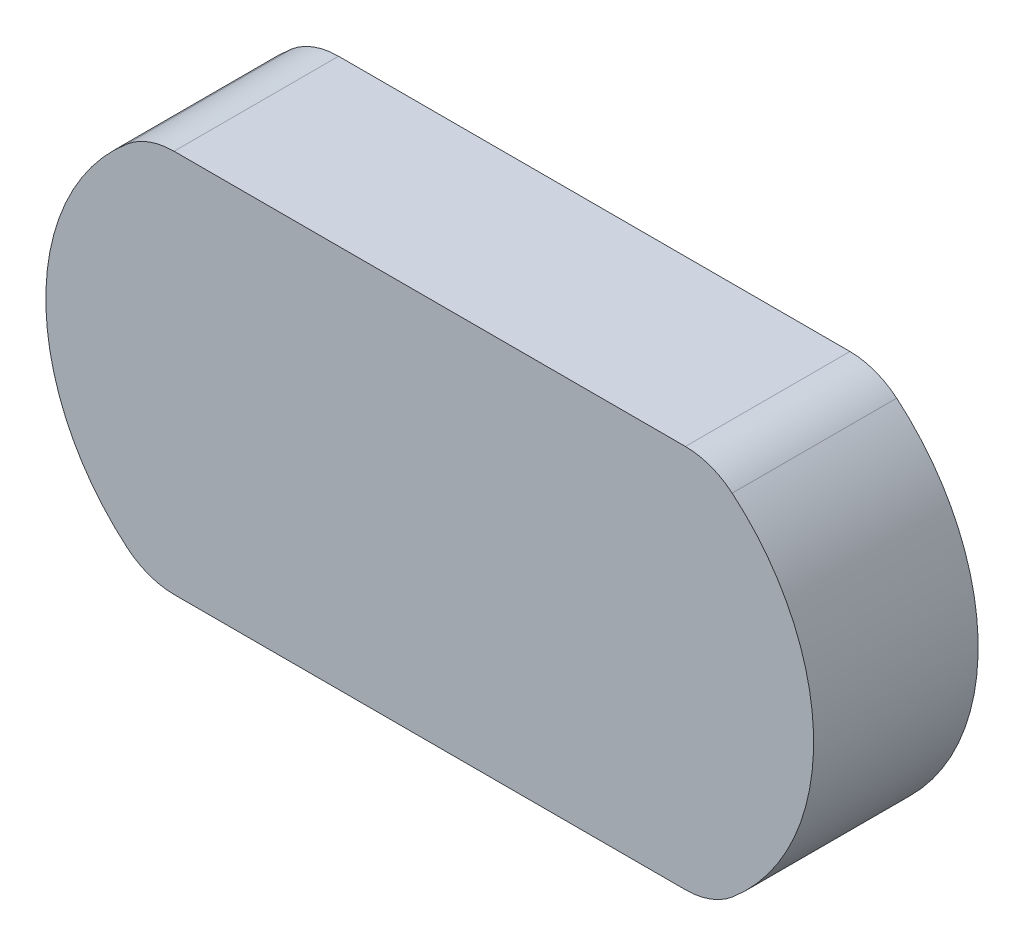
ISO-10303-21;
HEADER;
FILE_DESCRIPTION(('STEP AP214'),'2;1');
FILE_NAME('part.step','',(''),(''),'','','');
FILE_SCHEMA(('AUTOMOTIVE_DESIGN { 1 0 10303 214 1 1 1 1 }'));
ENDSEC;
DATA;
#1=APPLICATION_CONTEXT('core data for automotive mechanical design processes');
#2=APPLICATION_PROTOCOL_DEFINITION('international standard','automotive_design',2000,#1);
#3=PRODUCT_CONTEXT('',#1,'mechanical');
#4=PRODUCT('Part','Part','',(#3));
#5=PRODUCT_RELATED_PRODUCT_CATEGORY('part','',(#4));
#6=PRODUCT_DEFINITION_FORMATION('','',#4);
#7=PRODUCT_DEFINITION_CONTEXT('part definition',#1,'design');
#8=PRODUCT_DEFINITION('design','',#6,#7);
#9=PRODUCT_DEFINITION_SHAPE('','',#8);
#10=(LENGTH_UNIT() NAMED_UNIT(*) SI_UNIT(.MILLI.,.METRE.));
#11=(NAMED_UNIT(*) PLANE_ANGLE_UNIT() SI_UNIT($,.RADIAN.));
#12=(NAMED_UNIT(*) SI_UNIT($,.STERADIAN.) SOLID_ANGLE_UNIT());
#13=UNCERTAINTY_MEASURE_WITH_UNIT(LENGTH_MEASURE(1.E-05),#10,'distance_accuracy_value','');
#14=(GEOMETRIC_REPRESENTATION_CONTEXT(3) GLOBAL_UNCERTAINTY_ASSIGNED_CONTEXT((#13)) GLOBAL_UNIT_ASSIGNED_CONTEXT((#10,
#11,#12)) REPRESENTATION_CONTEXT('',''));
#15=CARTESIAN_POINT('',(0.,0.,0.));
#16=DIRECTION('',(0.,0.,1.));
#17=DIRECTION('',(1.,0.,0.));
#18=AXIS2_PLACEMENT_3D('',#15,#16,#17);
#19=CARTESIAN_POINT('',(-17.,0.,0.));
#20=DIRECTION('',(0.,0.,1.));
#21=DIRECTION('',(1.,0.,0.));
#22=AXIS2_PLACEMENT_3D('',#19,#20,#21);
#23=PLANE('',#22);
#24=CARTESIAN_POINT('',(-27.9726204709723,-13.0498,0.));
#25=DIRECTION('',(0.,0.,-1.));
#26=DIRECTION('',(-1.,0.,0.));
#27=AXIS2_PLACEMENT_3D('',#24,#25,#26);
#28=CIRCLE('',#27,7.9502);
#29=CARTESIAN_POINT('',(-33.0890750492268,-19.1348285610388,0.));
#30=VERTEX_POINT('',#29);
#31=CARTESIAN_POINT('',(-27.9726204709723,-21.,0.));
#32=VERTEX_POINT('',#31);
#33=EDGE_CURVE('E91',#30,#32,#28,.F.);
#34=ORIENTED_EDGE('',*,*,#33,.F.);
#35=CARTESIAN_POINT('',(-17.,0.,0.));
#36=DIRECTION('',(0.,0.,-1.));
#37=DIRECTION('',(-1.,0.,0.));
#38=AXIS2_PLACEMENT_3D('',#35,#36,#37);
#39=CIRCLE('',#38,25.);
#40=CARTESIAN_POINT('',(-33.0890750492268,19.1348285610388,0.));
#41=VERTEX_POINT('',#40);
#42=EDGE_CURVE('E20',#41,#30,#39,.F.);
#43=ORIENTED_EDGE('',*,*,#42,.F.);
#44=CARTESIAN_POINT('',(-27.9726204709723,13.0498,0.));
#45=DIRECTION('',(0.,0.,-1.));
#46=DIRECTION('',(-1.,0.,0.));
#47=AXIS2_PLACEMENT_3D('',#44,#45,#46);
#48=CIRCLE('',#47,7.9502);
#49=CARTESIAN_POINT('',(-27.9726204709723,21.,0.));
#50=VERTEX_POINT('',#49);
#51=EDGE_CURVE('E122',#50,#41,#48,.F.);
#52=ORIENTED_EDGE('',*,*,#51,.F.);
#53=DIRECTION('',(1.,0.,0.));
#54=VECTOR('',#53,1.);
#55=CARTESIAN_POINT('',(-30.5646599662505,21.,0.));
#56=LINE('',#55,#54);
#57=CARTESIAN_POINT('',(27.9726204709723,21.,0.));
#58=VERTEX_POINT('',#57);
#59=EDGE_CURVE('E104',#50,#58,#56,.T.);
#60=ORIENTED_EDGE('',*,*,#59,.T.);
#61=CARTESIAN_POINT('',(27.9726204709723,13.0498,0.));
#62=DIRECTION('',(0.,0.,-1.));
#63=DIRECTION('',(-1.,0.,0.));
#64=AXIS2_PLACEMENT_3D('',#61,#62,#63);
#65=CIRCLE('',#64,7.9502);
#66=CARTESIAN_POINT('',(33.0890750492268,19.1348285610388,0.));
#67=VERTEX_POINT('',#66);
#68=EDGE_CURVE('E107',#67,#58,#65,.F.);
#69=ORIENTED_EDGE('',*,*,#68,.F.);
#70=CARTESIAN_POINT('',(17.,0.,0.));
#71=DIRECTION('',(0.,0.,-1.));
#72=DIRECTION('',(-1.,0.,0.));
#73=AXIS2_PLACEMENT_3D('',#70,#71,#72);
#74=CIRCLE('',#73,25.);
#75=CARTESIAN_POINT('',(33.0890750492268,-19.1348285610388,0.));
#76=VERTEX_POINT('',#75);
#77=EDGE_CURVE('E127',#76,#67,#74,.F.);
#78=ORIENTED_EDGE('',*,*,#77,.F.);
#79=CARTESIAN_POINT('',(27.9726204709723,-13.0498,0.));
#80=DIRECTION('',(0.,0.,-1.));
#81=DIRECTION('',(-1.,0.,0.));
#82=AXIS2_PLACEMENT_3D('',#79,#80,#81);
#83=CIRCLE('',#82,7.9502);
#84=CARTESIAN_POINT('',(27.9726204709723,-21.,0.));
#85=VERTEX_POINT('',#84);
#86=EDGE_CURVE('E130',#85,#76,#83,.F.);
#87=ORIENTED_EDGE('',*,*,#86,.F.);
#88=DIRECTION('',(1.,0.,0.));
#89=VECTOR('',#88,1.);
#90=CARTESIAN_POINT('',(-30.5646599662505,-21.,0.));
#91=LINE('',#90,#89);
#92=EDGE_CURVE('E93',#85,#32,#91,.F.);
#93=ORIENTED_EDGE('',*,*,#92,.T.);
#94=EDGE_LOOP('',(#34,#43,#52,#60,#69,#78,#87,#93));
#95=FACE_BOUND('',#94,.T.);
#96=ADVANCED_FACE('F17',(#95),#23,.F.);
#97=CARTESIAN_POINT('',(-17.,0.,18.));
#98=DIRECTION('',(0.,0.,-1.));
#99=DIRECTION('',(-1.,0.,0.));
#100=AXIS2_PLACEMENT_3D('',#97,#98,#99);
#101=CYLINDRICAL_SURFACE('',#100,25.);
#102=ORIENTED_EDGE('',*,*,#42,.T.);
#103=DIRECTION('',(0.,0.,-1.));
#104=VECTOR('',#103,1.);
#105=CARTESIAN_POINT('',(-33.0890750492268,-19.1348285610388,18.));
#106=LINE('',#105,#104);
#107=CARTESIAN_POINT('',(-33.0890750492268,-19.1348285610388,18.));
#108=VERTEX_POINT('',#107);
#109=EDGE_CURVE('E83',#108,#30,#106,.T.);
#110=ORIENTED_EDGE('',*,*,#109,.F.);
#111=CARTESIAN_POINT('',(-17.,0.,18.));
#112=DIRECTION('',(0.,0.,-1.));
#113=DIRECTION('',(-1.,0.,0.));
#114=AXIS2_PLACEMENT_3D('',#111,#112,#113);
#115=CIRCLE('',#114,25.);
#116=CARTESIAN_POINT('',(-33.0890750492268,19.1348285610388,18.));
#117=VERTEX_POINT('',#116);
#118=EDGE_CURVE('E120',#117,#108,#115,.F.);
#119=ORIENTED_EDGE('',*,*,#118,.F.);
#120=DIRECTION('',(0.,0.,-1.));
#121=VECTOR('',#120,1.);
#122=CARTESIAN_POINT('',(-33.0890750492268,19.1348285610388,18.));
#123=LINE('',#122,#121);
#124=EDGE_CURVE('E86',#41,#117,#123,.F.);
#125=ORIENTED_EDGE('',*,*,#124,.F.);
#126=EDGE_LOOP('',(#102,#110,#119,#125));
#127=FACE_BOUND('',#126,.T.);
#128=ADVANCED_FACE('F81',(#127),#101,.T.);
#129=CARTESIAN_POINT('',(-27.9726204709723,-13.0498,18.));
#130=DIRECTION('',(0.,0.,-1.));
#131=DIRECTION('',(-1.,0.,0.));
#132=AXIS2_PLACEMENT_3D('',#129,#130,#131);
#133=CYLINDRICAL_SURFACE('',#132,7.9502);
#134=ORIENTED_EDGE('',*,*,#33,.T.);
#135=DIRECTION('',(0.,0.,1.));
#136=VECTOR('',#135,1.);
#137=CARTESIAN_POINT('',(-27.9726204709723,-21.,18.));
#138=LINE('',#137,#136);
#139=CARTESIAN_POINT('',(-27.9726204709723,-21.,18.));
#140=VERTEX_POINT('',#139);
#141=EDGE_CURVE('E102',#32,#140,#138,.T.);
#142=ORIENTED_EDGE('',*,*,#141,.T.);
#143=CARTESIAN_POINT('',(-27.9726204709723,-13.0498,18.));
#144=DIRECTION('',(0.,0.,-1.));
#145=DIRECTION('',(-1.,0.,0.));
#146=AXIS2_PLACEMENT_3D('',#143,#144,#145);
#147=CIRCLE('',#146,7.9502);
#148=EDGE_CURVE('E98',#108,#140,#147,.F.);
#149=ORIENTED_EDGE('',*,*,#148,.F.);
#150=ORIENTED_EDGE('',*,*,#109,.T.);
#151=EDGE_LOOP('',(#134,#142,#149,#150));
#152=FACE_BOUND('',#151,.T.);
#153=ADVANCED_FACE('F96',(#152),#133,.T.);
#154=CARTESIAN_POINT('',(-30.5646599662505,-21.,18.));
#155=DIRECTION('',(0.,1.,0.));
#156=DIRECTION('',(0.,0.,1.));
#157=AXIS2_PLACEMENT_3D('',#154,#155,#156);
#158=PLANE('',#157);
#159=ORIENTED_EDGE('',*,*,#141,.F.);
#160=ORIENTED_EDGE('',*,*,#92,.F.);
#161=DIRECTION('',(0.,0.,-1.));
#162=VECTOR('',#161,1.);
#163=CARTESIAN_POINT('',(27.9726204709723,-21.,18.));
#164=LINE('',#163,#162);
#165=CARTESIAN_POINT('',(27.9726204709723,-21.,18.));
#166=VERTEX_POINT('',#165);
#167=EDGE_CURVE('E131',#166,#85,#164,.T.);
#168=ORIENTED_EDGE('',*,*,#167,.F.);
#169=DIRECTION('',(1.,0.,0.));
#170=VECTOR('',#169,1.);
#171=CARTESIAN_POINT('',(-17.,-21.,18.));
#172=LINE('',#171,#170);
#173=EDGE_CURVE('E118',#140,#166,#172,.T.);
#174=ORIENTED_EDGE('',*,*,#173,.F.);
#175=EDGE_LOOP('',(#159,#160,#168,#174));
#176=FACE_BOUND('',#175,.T.);
#177=ADVANCED_FACE('F176',(#176),#158,.F.);
#178=CARTESIAN_POINT('',(27.9726204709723,-13.0498,18.));
#179=DIRECTION('',(0.,0.,-1.));
#180=DIRECTION('',(-1.,0.,0.));
#181=AXIS2_PLACEMENT_3D('',#178,#179,#180);
#182=CYLINDRICAL_SURFACE('',#181,7.9502);
#183=ORIENTED_EDGE('',*,*,#86,.T.);
#184=DIRECTION('',(0.,0.,-1.));
#185=VECTOR('',#184,1.);
#186=CARTESIAN_POINT('',(33.0890750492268,-19.1348285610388,18.));
#187=LINE('',#186,#185);
#188=CARTESIAN_POINT('',(33.0890750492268,-19.1348285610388,18.));
#189=VERTEX_POINT('',#188);
#190=EDGE_CURVE('E129',#189,#76,#187,.T.);
#191=ORIENTED_EDGE('',*,*,#190,.F.);
#192=CARTESIAN_POINT('',(27.9726204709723,-13.0498,18.));
#193=DIRECTION('',(0.,0.,-1.));
#194=DIRECTION('',(-1.,0.,0.));
#195=AXIS2_PLACEMENT_3D('',#192,#193,#194);
#196=CIRCLE('',#195,7.9502);
#197=EDGE_CURVE('E115',#166,#189,#196,.F.);
#198=ORIENTED_EDGE('',*,*,#197,.F.);
#199=ORIENTED_EDGE('',*,*,#167,.T.);
#200=EDGE_LOOP('',(#183,#191,#198,#199));
#201=FACE_BOUND('',#200,.T.);
#202=ADVANCED_FACE('F172',(#201),#182,.T.);
#203=CARTESIAN_POINT('',(17.,0.,18.));
#204=DIRECTION('',(0.,0.,-1.));
#205=DIRECTION('',(-1.,0.,0.));
#206=AXIS2_PLACEMENT_3D('',#203,#204,#205);
#207=CYLINDRICAL_SURFACE('',#206,25.);
#208=ORIENTED_EDGE('',*,*,#77,.T.);
#209=DIRECTION('',(0.,0.,-1.));
#210=VECTOR('',#209,1.);
#211=CARTESIAN_POINT('',(33.0890750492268,19.1348285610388,18.));
#212=LINE('',#211,#210);
#213=CARTESIAN_POINT('',(33.0890750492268,19.1348285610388,18.));
#214=VERTEX_POINT('',#213);
#215=EDGE_CURVE('E126',#214,#67,#212,.T.);
#216=ORIENTED_EDGE('',*,*,#215,.F.);
#217=CARTESIAN_POINT('',(17.,0.,18.));
#218=DIRECTION('',(0.,0.,-1.));
#219=DIRECTION('',(-1.,0.,0.));
#220=AXIS2_PLACEMENT_3D('',#217,#218,#219);
#221=CIRCLE('',#220,25.);
#222=EDGE_CURVE('E112',#189,#214,#221,.F.);
#223=ORIENTED_EDGE('',*,*,#222,.F.);
#224=ORIENTED_EDGE('',*,*,#190,.T.);
#225=EDGE_LOOP('',(#208,#216,#223,#224));
#226=FACE_BOUND('',#225,.T.);
#227=ADVANCED_FACE('F169',(#226),#207,.T.);
#228=CARTESIAN_POINT('',(27.9726204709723,13.0498,18.));
#229=DIRECTION('',(0.,0.,-1.));
#230=DIRECTION('',(-1.,0.,0.));
#231=AXIS2_PLACEMENT_3D('',#228,#229,#230);
#232=CYLINDRICAL_SURFACE('',#231,7.9502);
#233=ORIENTED_EDGE('',*,*,#68,.T.);
#234=DIRECTION('',(0.,0.,-1.));
#235=VECTOR('',#234,1.);
#236=CARTESIAN_POINT('',(27.9726204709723,21.,18.));
#237=LINE('',#236,#235);
#238=CARTESIAN_POINT('',(27.9726204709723,21.,18.));
#239=VERTEX_POINT('',#238);
#240=EDGE_CURVE('E106',#58,#239,#237,.F.);
#241=ORIENTED_EDGE('',*,*,#240,.T.);
#242=CARTESIAN_POINT('',(27.9726204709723,13.0498,18.));
#243=DIRECTION('',(0.,0.,-1.));
#244=DIRECTION('',(-1.,0.,0.));
#245=AXIS2_PLACEMENT_3D('',#242,#243,#244);
#246=CIRCLE('',#245,7.9502);
#247=EDGE_CURVE('E109',#214,#239,#246,.F.);
#248=ORIENTED_EDGE('',*,*,#247,.F.);
#249=ORIENTED_EDGE('',*,*,#215,.T.);
#250=EDGE_LOOP('',(#233,#241,#248,#249));
#251=FACE_BOUND('',#250,.T.);
#252=ADVANCED_FACE('F153',(#251),#232,.T.);
#253=CARTESIAN_POINT('',(-30.5646599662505,21.,18.));
#254=DIRECTION('',(0.,-1.,0.));
#255=DIRECTION('',(0.,0.,-1.));
#256=AXIS2_PLACEMENT_3D('',#253,#254,#255);
#257=PLANE('',#256);
#258=ORIENTED_EDGE('',*,*,#240,.F.);
#259=ORIENTED_EDGE('',*,*,#59,.F.);
#260=DIRECTION('',(0.,0.,-1.));
#261=VECTOR('',#260,1.);
#262=CARTESIAN_POINT('',(-27.9726204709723,21.,18.));
#263=LINE('',#262,#261);
#264=CARTESIAN_POINT('',(-27.9726204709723,21.,18.));
#265=VERTEX_POINT('',#264);
#266=EDGE_CURVE('E35',#265,#50,#263,.T.);
#267=ORIENTED_EDGE('',*,*,#266,.F.);
#268=DIRECTION('',(1.,0.,0.));
#269=VECTOR('',#268,1.);
#270=CARTESIAN_POINT('',(-17.,21.,18.));
#271=LINE('',#270,#269);
#272=EDGE_CURVE('E26',#239,#265,#271,.F.);
#273=ORIENTED_EDGE('',*,*,#272,.F.);
#274=EDGE_LOOP('',(#258,#259,#267,#273));
#275=FACE_BOUND('',#274,.T.);
#276=ADVANCED_FACE('F151',(#275),#257,.F.);
#277=CARTESIAN_POINT('',(-27.9726204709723,13.0498,18.));
#278=DIRECTION('',(0.,0.,-1.));
#279=DIRECTION('',(-1.,0.,0.));
#280=AXIS2_PLACEMENT_3D('',#277,#278,#279);
#281=CYLINDRICAL_SURFACE('',#280,7.9502);
#282=ORIENTED_EDGE('',*,*,#51,.T.);
#283=ORIENTED_EDGE('',*,*,#124,.T.);
#284=CARTESIAN_POINT('',(-27.9726204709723,13.0498,18.));
#285=DIRECTION('',(0.,0.,-1.));
#286=DIRECTION('',(-1.,0.,0.));
#287=AXIS2_PLACEMENT_3D('',#284,#285,#286);
#288=CIRCLE('',#287,7.9502);
#289=EDGE_CURVE('E11',#265,#117,#288,.F.);
#290=ORIENTED_EDGE('',*,*,#289,.F.);
#291=ORIENTED_EDGE('',*,*,#266,.T.);
#292=EDGE_LOOP('',(#282,#283,#290,#291));
#293=FACE_BOUND('',#292,.T.);
#294=ADVANCED_FACE('F156',(#293),#281,.T.);
#295=CARTESIAN_POINT('',(-17.,0.,18.));
#296=DIRECTION('',(0.,0.,1.));
#297=DIRECTION('',(1.,0.,0.));
#298=AXIS2_PLACEMENT_3D('',#295,#296,#297);
#299=PLANE('',#298);
#300=ORIENTED_EDGE('',*,*,#272,.T.);
#301=ORIENTED_EDGE('',*,*,#289,.T.);
#302=ORIENTED_EDGE('',*,*,#118,.T.);
#303=ORIENTED_EDGE('',*,*,#148,.T.);
#304=ORIENTED_EDGE('',*,*,#173,.T.);
#305=ORIENTED_EDGE('',*,*,#197,.T.);
#306=ORIENTED_EDGE('',*,*,#222,.T.);
#307=ORIENTED_EDGE('',*,*,#247,.T.);
#308=EDGE_LOOP('',(#300,#301,#302,#303,#304,#305,#306,#307));
#309=FACE_BOUND('',#308,.T.);
#310=ADVANCED_FACE('F148',(#309),#299,.T.);
#311=CLOSED_SHELL('',(#96,#128,#153,#177,#202,#227,#252,#276,#294,#310));
#312=MANIFOLD_SOLID_BREP('B1',#311);
#313=ADVANCED_BREP_SHAPE_REPRESENTATION('',(#18,#312),#14);
#314=SHAPE_DEFINITION_REPRESENTATION(#9,#313);
ENDSEC;
END-ISO-10303-21;
